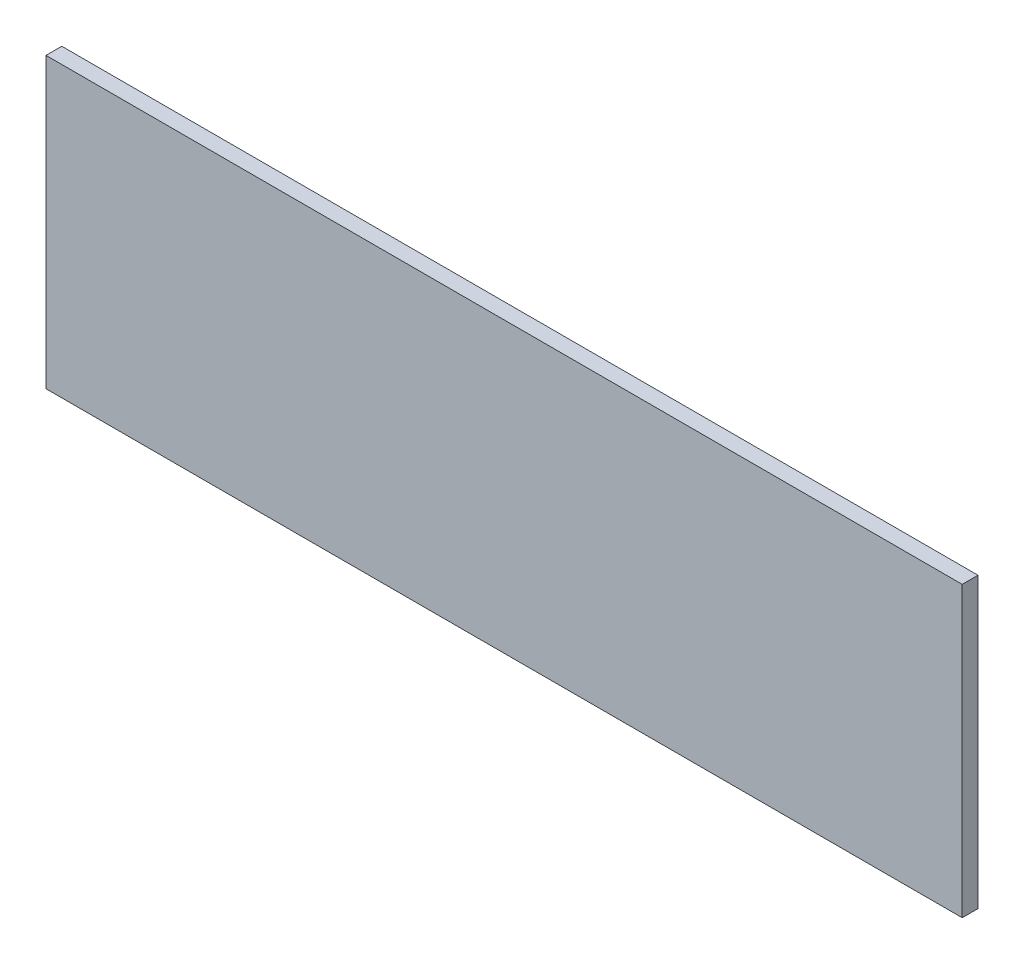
ISO-10303-21;
HEADER;
FILE_DESCRIPTION(('STEP AP214'),'2;1');
FILE_NAME('part.step','',(''),(''),'','','');
FILE_SCHEMA(('AUTOMOTIVE_DESIGN { 1 0 10303 214 1 1 1 1 }'));
ENDSEC;
DATA;
#1=APPLICATION_CONTEXT('core data for automotive mechanical design processes');
#2=APPLICATION_PROTOCOL_DEFINITION('international standard','automotive_design',2000,#1);
#3=PRODUCT_CONTEXT('',#1,'mechanical');
#4=PRODUCT('Part','Part','',(#3));
#5=PRODUCT_RELATED_PRODUCT_CATEGORY('part','',(#4));
#6=PRODUCT_DEFINITION_FORMATION('','',#4);
#7=PRODUCT_DEFINITION_CONTEXT('part definition',#1,'design');
#8=PRODUCT_DEFINITION('design','',#6,#7);
#9=PRODUCT_DEFINITION_SHAPE('','',#8);
#10=(LENGTH_UNIT() NAMED_UNIT(*) SI_UNIT(.MILLI.,.METRE.));
#11=(NAMED_UNIT(*) PLANE_ANGLE_UNIT() SI_UNIT($,.RADIAN.));
#12=(NAMED_UNIT(*) SI_UNIT($,.STERADIAN.) SOLID_ANGLE_UNIT());
#13=UNCERTAINTY_MEASURE_WITH_UNIT(LENGTH_MEASURE(1.E-05),#10,'distance_accuracy_value','');
#14=(GEOMETRIC_REPRESENTATION_CONTEXT(3) GLOBAL_UNCERTAINTY_ASSIGNED_CONTEXT((#13)) GLOBAL_UNIT_ASSIGNED_CONTEXT((#10,
#11,#12)) REPRESENTATION_CONTEXT('',''));
#15=CARTESIAN_POINT('',(0.,0.,0.));
#16=DIRECTION('',(0.,0.,1.));
#17=DIRECTION('',(1.,0.,0.));
#18=AXIS2_PLACEMENT_3D('',#15,#16,#17);
#19=CARTESIAN_POINT('',(600.,-135.491079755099,402.300331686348));
#20=DIRECTION('',(0.,0.,1.));
#21=DIRECTION('',(1.,0.,0.));
#22=AXIS2_PLACEMENT_3D('',#19,#20,#21);
#23=PLANE('',#22);
#24=DIRECTION('',(0.,-1.,0.));
#25=VECTOR('',#24,1.);
#26=CARTESIAN_POINT('',(10.,0.,402.300331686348));
#27=LINE('',#26,#25);
#28=CARTESIAN_POINT('',(10.,-135.491079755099,402.300331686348));
#29=VERTEX_POINT('',#28);
#30=CARTESIAN_POINT('',(10.,-318.271079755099,402.300331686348));
#31=VERTEX_POINT('',#30);
#32=EDGE_CURVE('E55',#29,#31,#27,.T.);
#33=ORIENTED_EDGE('',*,*,#32,.F.);
#34=DIRECTION('',(-1.,0.,0.));
#35=VECTOR('',#34,1.);
#36=CARTESIAN_POINT('',(600.,-135.491079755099,402.300331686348));
#37=LINE('',#36,#35);
#38=CARTESIAN_POINT('',(590.,-135.491079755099,402.300331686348));
#39=VERTEX_POINT('',#38);
#40=EDGE_CURVE('E11',#39,#29,#37,.T.);
#41=ORIENTED_EDGE('',*,*,#40,.F.);
#42=DIRECTION('',(0.,-1.,0.));
#43=VECTOR('',#42,1.);
#44=CARTESIAN_POINT('',(590.,-135.491079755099,402.300331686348));
#45=LINE('',#44,#43);
#46=CARTESIAN_POINT('',(590.,-318.271079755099,402.300331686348));
#47=VERTEX_POINT('',#46);
#48=EDGE_CURVE('E94',#39,#47,#45,.T.);
#49=ORIENTED_EDGE('',*,*,#48,.T.);
#50=DIRECTION('',(-1.,0.,0.));
#51=VECTOR('',#50,1.);
#52=CARTESIAN_POINT('',(600.,-318.271079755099,402.300331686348));
#53=LINE('',#52,#51);
#54=EDGE_CURVE('E89',#47,#31,#53,.T.);
#55=ORIENTED_EDGE('',*,*,#54,.T.);
#56=EDGE_LOOP('',(#33,#41,#49,#55));
#57=FACE_BOUND('',#56,.T.);
#58=ADVANCED_FACE('F33',(#57),#23,.F.);
#59=CARTESIAN_POINT('',(600.,-135.491079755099,402.300331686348));
#60=DIRECTION('',(0.,-1.,0.));
#61=DIRECTION('',(0.,0.,-1.));
#62=AXIS2_PLACEMENT_3D('',#59,#60,#61);
#63=PLANE('',#62);
#64=DIRECTION('',(0.,0.,1.));
#65=VECTOR('',#64,1.);
#66=CARTESIAN_POINT('',(10.,-135.491079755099,402.300331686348));
#67=LINE('',#66,#65);
#68=CARTESIAN_POINT('',(10.,-135.491079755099,412.300331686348));
#69=VERTEX_POINT('',#68);
#70=EDGE_CURVE('E74',#29,#69,#67,.T.);
#71=ORIENTED_EDGE('',*,*,#70,.T.);
#72=DIRECTION('',(-1.,0.,0.));
#73=VECTOR('',#72,1.);
#74=CARTESIAN_POINT('',(600.,-135.491079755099,412.300331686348));
#75=LINE('',#74,#73);
#76=CARTESIAN_POINT('',(590.,-135.491079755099,412.300331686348));
#77=VERTEX_POINT('',#76);
#78=EDGE_CURVE('E40',#77,#69,#75,.T.);
#79=ORIENTED_EDGE('',*,*,#78,.F.);
#80=DIRECTION('',(0.,0.,1.));
#81=VECTOR('',#80,1.);
#82=CARTESIAN_POINT('',(590.,-135.491079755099,402.300331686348));
#83=LINE('',#82,#81);
#84=EDGE_CURVE('E97',#39,#77,#83,.T.);
#85=ORIENTED_EDGE('',*,*,#84,.F.);
#86=ORIENTED_EDGE('',*,*,#40,.T.);
#87=EDGE_LOOP('',(#71,#79,#85,#86));
#88=FACE_BOUND('',#87,.T.);
#89=ADVANCED_FACE('F83',(#88),#63,.F.);
#90=CARTESIAN_POINT('',(600.,-135.491079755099,412.300331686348));
#91=DIRECTION('',(0.,0.,-1.));
#92=DIRECTION('',(-1.,0.,0.));
#93=AXIS2_PLACEMENT_3D('',#90,#91,#92);
#94=PLANE('',#93);
#95=DIRECTION('',(0.,-1.,0.));
#96=VECTOR('',#95,1.);
#97=CARTESIAN_POINT('',(10.,0.,412.300331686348));
#98=LINE('',#97,#96);
#99=CARTESIAN_POINT('',(10.,-318.271079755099,412.300331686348));
#100=VERTEX_POINT('',#99);
#101=EDGE_CURVE('E71',#69,#100,#98,.T.);
#102=ORIENTED_EDGE('',*,*,#101,.T.);
#103=DIRECTION('',(-1.,0.,0.));
#104=VECTOR('',#103,1.);
#105=CARTESIAN_POINT('',(600.,-318.271079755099,412.300331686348));
#106=LINE('',#105,#104);
#107=CARTESIAN_POINT('',(590.,-318.271079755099,412.300331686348));
#108=VERTEX_POINT('',#107);
#109=EDGE_CURVE('E88',#108,#100,#106,.T.);
#110=ORIENTED_EDGE('',*,*,#109,.F.);
#111=DIRECTION('',(0.,-1.,0.));
#112=VECTOR('',#111,1.);
#113=CARTESIAN_POINT('',(590.,-135.491079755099,412.300331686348));
#114=LINE('',#113,#112);
#115=EDGE_CURVE('E47',#77,#108,#114,.T.);
#116=ORIENTED_EDGE('',*,*,#115,.F.);
#117=ORIENTED_EDGE('',*,*,#78,.T.);
#118=EDGE_LOOP('',(#102,#110,#116,#117));
#119=FACE_BOUND('',#118,.T.);
#120=ADVANCED_FACE('F87',(#119),#94,.F.);
#121=CARTESIAN_POINT('',(600.,-318.271079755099,402.300331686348));
#122=DIRECTION('',(0.,1.,0.));
#123=DIRECTION('',(0.,0.,1.));
#124=AXIS2_PLACEMENT_3D('',#121,#122,#123);
#125=PLANE('',#124);
#126=DIRECTION('',(0.,0.,1.));
#127=VECTOR('',#126,1.);
#128=CARTESIAN_POINT('',(10.,-318.271079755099,402.300331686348));
#129=LINE('',#128,#127);
#130=EDGE_CURVE('E75',#31,#100,#129,.T.);
#131=ORIENTED_EDGE('',*,*,#130,.F.);
#132=ORIENTED_EDGE('',*,*,#54,.F.);
#133=DIRECTION('',(0.,0.,1.));
#134=VECTOR('',#133,1.);
#135=CARTESIAN_POINT('',(590.,-318.271079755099,402.300331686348));
#136=LINE('',#135,#134);
#137=EDGE_CURVE('E99',#47,#108,#136,.T.);
#138=ORIENTED_EDGE('',*,*,#137,.T.);
#139=ORIENTED_EDGE('',*,*,#109,.T.);
#140=EDGE_LOOP('',(#131,#132,#138,#139));
#141=FACE_BOUND('',#140,.T.);
#142=ADVANCED_FACE('F107',(#141),#125,.F.);
#143=CARTESIAN_POINT('',(590.,-135.491079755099,402.300331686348));
#144=DIRECTION('',(-1.,0.,0.));
#145=DIRECTION('',(0.,0.,1.));
#146=AXIS2_PLACEMENT_3D('',#143,#144,#145);
#147=PLANE('',#146);
#148=ORIENTED_EDGE('',*,*,#115,.T.);
#149=ORIENTED_EDGE('',*,*,#137,.F.);
#150=ORIENTED_EDGE('',*,*,#48,.F.);
#151=ORIENTED_EDGE('',*,*,#84,.T.);
#152=EDGE_LOOP('',(#148,#149,#150,#151));
#153=FACE_BOUND('',#152,.T.);
#154=ADVANCED_FACE('F103',(#153),#147,.F.);
#155=CARTESIAN_POINT('',(10.,0.,402.300331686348));
#156=DIRECTION('',(-1.,0.,0.));
#157=DIRECTION('',(0.,0.,1.));
#158=AXIS2_PLACEMENT_3D('',#155,#156,#157);
#159=PLANE('',#158);
#160=ORIENTED_EDGE('',*,*,#101,.F.);
#161=ORIENTED_EDGE('',*,*,#70,.F.);
#162=ORIENTED_EDGE('',*,*,#32,.T.);
#163=ORIENTED_EDGE('',*,*,#130,.T.);
#164=EDGE_LOOP('',(#160,#161,#162,#163));
#165=FACE_BOUND('',#164,.T.);
#166=ADVANCED_FACE('F73',(#165),#159,.T.);
#167=CLOSED_SHELL('',(#58,#89,#120,#142,#154,#166));
#168=MANIFOLD_SOLID_BREP('B2',#167);
#169=ADVANCED_BREP_SHAPE_REPRESENTATION('',(#18,#168),#14);
#170=SHAPE_DEFINITION_REPRESENTATION(#9,#169);
ENDSEC;
END-ISO-10303-21;
